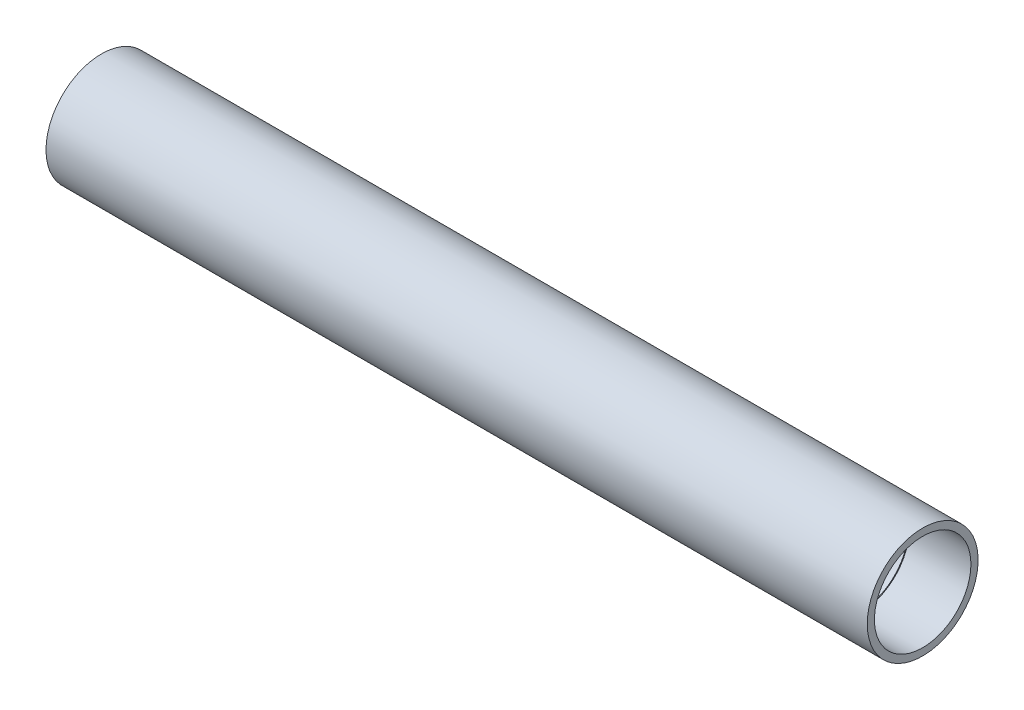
ISO-10303-21;
HEADER;
FILE_DESCRIPTION(('STEP AP214'),'2;1');
FILE_NAME('part.step','',(''),(''),'','','');
FILE_SCHEMA(('AUTOMOTIVE_DESIGN { 1 0 10303 214 1 1 1 1 }'));
ENDSEC;
DATA;
#1=APPLICATION_CONTEXT('core data for automotive mechanical design processes');
#2=APPLICATION_PROTOCOL_DEFINITION('international standard','automotive_design',2000,#1);
#3=PRODUCT_CONTEXT('',#1,'mechanical');
#4=PRODUCT('Part','Part','',(#3));
#5=PRODUCT_RELATED_PRODUCT_CATEGORY('part','',(#4));
#6=PRODUCT_DEFINITION_FORMATION('','',#4);
#7=PRODUCT_DEFINITION_CONTEXT('part definition',#1,'design');
#8=PRODUCT_DEFINITION('design','',#6,#7);
#9=PRODUCT_DEFINITION_SHAPE('','',#8);
#10=(LENGTH_UNIT() NAMED_UNIT(*) SI_UNIT(.MILLI.,.METRE.));
#11=(NAMED_UNIT(*) PLANE_ANGLE_UNIT() SI_UNIT($,.RADIAN.));
#12=(NAMED_UNIT(*) SI_UNIT($,.STERADIAN.) SOLID_ANGLE_UNIT());
#13=UNCERTAINTY_MEASURE_WITH_UNIT(LENGTH_MEASURE(1.E-05),#10,'distance_accuracy_value','');
#14=(GEOMETRIC_REPRESENTATION_CONTEXT(3) GLOBAL_UNCERTAINTY_ASSIGNED_CONTEXT((#13)) GLOBAL_UNIT_ASSIGNED_CONTEXT((#10,
#11,#12)) REPRESENTATION_CONTEXT('',''));
#15=CARTESIAN_POINT('',(0.,0.,0.));
#16=DIRECTION('',(0.,0.,1.));
#17=DIRECTION('',(1.,0.,0.));
#18=AXIS2_PLACEMENT_3D('',#15,#16,#17);
#19=CARTESIAN_POINT('',(400.,0.,0.));
#20=DIRECTION('',(-1.,0.,0.));
#21=DIRECTION('',(0.,0.,1.));
#22=AXIS2_PLACEMENT_3D('',#19,#20,#21);
#23=CYLINDRICAL_SURFACE('',#22,23.);
#24=CARTESIAN_POINT('',(30.,0.,0.));
#25=DIRECTION('',(-1.,0.,0.));
#26=DIRECTION('',(0.,0.,1.));
#27=AXIS2_PLACEMENT_3D('',#24,#25,#26);
#28=CIRCLE('',#27,23.);
#29=CARTESIAN_POINT('',(30.,0.,23.));
#30=VERTEX_POINT('',#29);
#31=EDGE_CURVE('E40',#30,#30,#28,.F.);
#32=ORIENTED_EDGE('',*,*,#31,.F.);
#33=EDGE_LOOP('',(#32));
#34=FACE_BOUND('',#33,.T.);
#35=CARTESIAN_POINT('',(370.,0.,0.));
#36=DIRECTION('',(-1.,0.,0.));
#37=DIRECTION('',(0.,0.,1.));
#38=AXIS2_PLACEMENT_3D('',#35,#36,#37);
#39=CIRCLE('',#38,23.);
#40=CARTESIAN_POINT('',(370.,0.,23.));
#41=VERTEX_POINT('',#40);
#42=EDGE_CURVE('E18',#41,#41,#39,.T.);
#43=ORIENTED_EDGE('',*,*,#42,.F.);
#44=EDGE_LOOP('',(#43));
#45=FACE_BOUND('',#44,.T.);
#46=ADVANCED_FACE('F15',(#34,#45),#23,.F.);
#47=CARTESIAN_POINT('',(370.,0.,0.));
#48=DIRECTION('',(1.,0.,0.));
#49=DIRECTION('',(0.,0.,-1.));
#50=AXIS2_PLACEMENT_3D('',#47,#48,#49);
#51=PLANE('',#50);
#52=CARTESIAN_POINT('',(370.,0.,0.));
#53=DIRECTION('',(1.,0.,0.));
#54=DIRECTION('',(0.,0.,-1.));
#55=AXIS2_PLACEMENT_3D('',#52,#53,#54);
#56=CIRCLE('',#55,23.5);
#57=CARTESIAN_POINT('',(370.,0.,-23.5));
#58=VERTEX_POINT('',#57);
#59=EDGE_CURVE('E38',#58,#58,#56,.T.);
#60=ORIENTED_EDGE('',*,*,#59,.T.);
#61=EDGE_LOOP('',(#60));
#62=FACE_BOUND('',#61,.T.);
#63=ORIENTED_EDGE('',*,*,#42,.T.);
#64=EDGE_LOOP('',(#63));
#65=FACE_BOUND('',#64,.T.);
#66=ADVANCED_FACE('F47',(#62,#65),#51,.T.);
#67=CARTESIAN_POINT('',(30.,0.,0.));
#68=DIRECTION('',(-1.,0.,0.));
#69=DIRECTION('',(0.,0.,1.));
#70=AXIS2_PLACEMENT_3D('',#67,#68,#69);
#71=PLANE('',#70);
#72=CARTESIAN_POINT('',(30.,0.,0.));
#73=DIRECTION('',(-1.,0.,0.));
#74=DIRECTION('',(0.,0.,1.));
#75=AXIS2_PLACEMENT_3D('',#72,#73,#74);
#76=CIRCLE('',#75,23.5);
#77=CARTESIAN_POINT('',(30.,0.,23.5));
#78=VERTEX_POINT('',#77);
#79=EDGE_CURVE('E35',#78,#78,#76,.T.);
#80=ORIENTED_EDGE('',*,*,#79,.T.);
#81=EDGE_LOOP('',(#80));
#82=FACE_BOUND('',#81,.T.);
#83=ORIENTED_EDGE('',*,*,#31,.T.);
#84=EDGE_LOOP('',(#83));
#85=FACE_BOUND('',#84,.T.);
#86=ADVANCED_FACE('F55',(#82,#85),#71,.T.);
#87=CARTESIAN_POINT('',(370.,0.,0.));
#88=DIRECTION('',(1.,0.,0.));
#89=DIRECTION('',(0.,0.,-1.));
#90=AXIS2_PLACEMENT_3D('',#87,#88,#89);
#91=CYLINDRICAL_SURFACE('',#90,23.5);
#92=CARTESIAN_POINT('',(400.,0.,0.));
#93=DIRECTION('',(1.,0.,0.));
#94=DIRECTION('',(0.,0.,-1.));
#95=AXIS2_PLACEMENT_3D('',#92,#93,#94);
#96=CIRCLE('',#95,23.5);
#97=CARTESIAN_POINT('',(400.,0.,-23.5));
#98=VERTEX_POINT('',#97);
#99=EDGE_CURVE('E32',#98,#98,#96,.F.);
#100=ORIENTED_EDGE('',*,*,#99,.F.);
#101=EDGE_LOOP('',(#100));
#102=FACE_BOUND('',#101,.T.);
#103=ORIENTED_EDGE('',*,*,#59,.F.);
#104=EDGE_LOOP('',(#103));
#105=FACE_BOUND('',#104,.T.);
#106=ADVANCED_FACE('F75',(#102,#105),#91,.F.);
#107=CARTESIAN_POINT('',(30.,0.,0.));
#108=DIRECTION('',(-1.,0.,0.));
#109=DIRECTION('',(0.,0.,1.));
#110=AXIS2_PLACEMENT_3D('',#107,#108,#109);
#111=CYLINDRICAL_SURFACE('',#110,23.5);
#112=ORIENTED_EDGE('',*,*,#79,.F.);
#113=EDGE_LOOP('',(#112));
#114=FACE_BOUND('',#113,.T.);
#115=CARTESIAN_POINT('',(0.,0.,0.));
#116=DIRECTION('',(-1.,0.,0.));
#117=DIRECTION('',(0.,0.,1.));
#118=AXIS2_PLACEMENT_3D('',#115,#116,#117);
#119=CIRCLE('',#118,23.5);
#120=CARTESIAN_POINT('',(0.,0.,23.5));
#121=VERTEX_POINT('',#120);
#122=EDGE_CURVE('E27',#121,#121,#119,.T.);
#123=ORIENTED_EDGE('',*,*,#122,.T.);
#124=EDGE_LOOP('',(#123));
#125=FACE_BOUND('',#124,.T.);
#126=ADVANCED_FACE('F71',(#114,#125),#111,.F.);
#127=CARTESIAN_POINT('',(400.,0.,0.));
#128=DIRECTION('',(1.,0.,0.));
#129=DIRECTION('',(0.,0.,-1.));
#130=AXIS2_PLACEMENT_3D('',#127,#128,#129);
#131=PLANE('',#130);
#132=CARTESIAN_POINT('',(400.,0.,0.));
#133=DIRECTION('',(-1.,0.,0.));
#134=DIRECTION('',(0.,0.,1.));
#135=AXIS2_PLACEMENT_3D('',#132,#133,#134);
#136=CIRCLE('',#135,27.);
#137=CARTESIAN_POINT('',(400.,0.,27.));
#138=VERTEX_POINT('',#137);
#139=EDGE_CURVE('E22',#138,#138,#136,.T.);
#140=ORIENTED_EDGE('',*,*,#139,.F.);
#141=EDGE_LOOP('',(#140));
#142=FACE_BOUND('',#141,.T.);
#143=ORIENTED_EDGE('',*,*,#99,.T.);
#144=EDGE_LOOP('',(#143));
#145=FACE_BOUND('',#144,.T.);
#146=ADVANCED_FACE('F64',(#142,#145),#131,.T.);
#147=CARTESIAN_POINT('',(0.,0.,0.));
#148=DIRECTION('',(1.,0.,0.));
#149=DIRECTION('',(0.,0.,-1.));
#150=AXIS2_PLACEMENT_3D('',#147,#148,#149);
#151=PLANE('',#150);
#152=CARTESIAN_POINT('',(0.,0.,0.));
#153=DIRECTION('',(-1.,0.,0.));
#154=DIRECTION('',(0.,0.,1.));
#155=AXIS2_PLACEMENT_3D('',#152,#153,#154);
#156=CIRCLE('',#155,27.);
#157=CARTESIAN_POINT('',(0.,0.,27.));
#158=VERTEX_POINT('',#157);
#159=EDGE_CURVE('E10',#158,#158,#156,.F.);
#160=ORIENTED_EDGE('',*,*,#159,.F.);
#161=EDGE_LOOP('',(#160));
#162=FACE_BOUND('',#161,.T.);
#163=ORIENTED_EDGE('',*,*,#122,.F.);
#164=EDGE_LOOP('',(#163));
#165=FACE_BOUND('',#164,.T.);
#166=ADVANCED_FACE('F59',(#162,#165),#151,.F.);
#167=CARTESIAN_POINT('',(400.,0.,0.));
#168=DIRECTION('',(-1.,0.,0.));
#169=DIRECTION('',(0.,0.,1.));
#170=AXIS2_PLACEMENT_3D('',#167,#168,#169);
#171=CYLINDRICAL_SURFACE('',#170,27.);
#172=ORIENTED_EDGE('',*,*,#159,.T.);
#173=EDGE_LOOP('',(#172));
#174=FACE_BOUND('',#173,.T.);
#175=ORIENTED_EDGE('',*,*,#139,.T.);
#176=EDGE_LOOP('',(#175));
#177=FACE_BOUND('',#176,.T.);
#178=ADVANCED_FACE('F57',(#174,#177),#171,.T.);
#179=CLOSED_SHELL('',(#46,#66,#86,#106,#126,#146,#166,#178));
#180=MANIFOLD_SOLID_BREP('B1',#179);
#181=ADVANCED_BREP_SHAPE_REPRESENTATION('',(#18,#180),#14);
#182=SHAPE_DEFINITION_REPRESENTATION(#9,#181);
ENDSEC;
END-ISO-10303-21;
